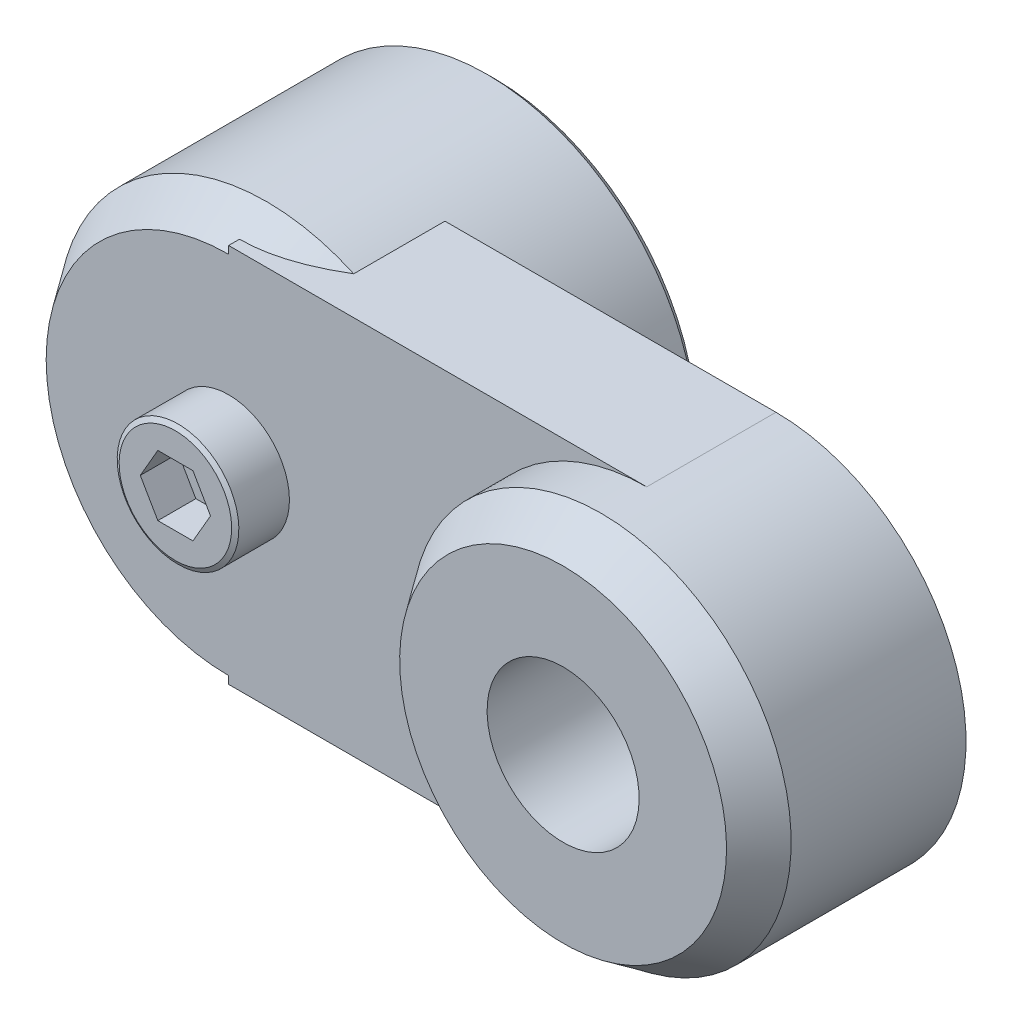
ISO-10303-21;
HEADER;
FILE_DESCRIPTION(('STEP AP214'),'2;1');
FILE_NAME('part.step','',(''),(''),'','','');
FILE_SCHEMA(('AUTOMOTIVE_DESIGN { 1 0 10303 214 1 1 1 1 }'));
ENDSEC;
DATA;
#1=APPLICATION_CONTEXT('core data for automotive mechanical design processes');
#2=APPLICATION_PROTOCOL_DEFINITION('international standard','automotive_design',2000,#1);
#3=PRODUCT_CONTEXT('',#1,'mechanical');
#4=PRODUCT('Part','Part','',(#3));
#5=PRODUCT_RELATED_PRODUCT_CATEGORY('part','',(#4));
#6=PRODUCT_DEFINITION_FORMATION('','',#4);
#7=PRODUCT_DEFINITION_CONTEXT('part definition',#1,'design');
#8=PRODUCT_DEFINITION('design','',#6,#7);
#9=PRODUCT_DEFINITION_SHAPE('','',#8);
#10=(LENGTH_UNIT() NAMED_UNIT(*) SI_UNIT(.MILLI.,.METRE.));
#11=(NAMED_UNIT(*) PLANE_ANGLE_UNIT() SI_UNIT($,.RADIAN.));
#12=(NAMED_UNIT(*) SI_UNIT($,.STERADIAN.) SOLID_ANGLE_UNIT());
#13=UNCERTAINTY_MEASURE_WITH_UNIT(LENGTH_MEASURE(1.E-05),#10,'distance_accuracy_value','');
#14=(GEOMETRIC_REPRESENTATION_CONTEXT(3) GLOBAL_UNCERTAINTY_ASSIGNED_CONTEXT((#13)) GLOBAL_UNIT_ASSIGNED_CONTEXT((#10,
#11,#12)) REPRESENTATION_CONTEXT('',''));
#15=CARTESIAN_POINT('',(0.,0.,0.));
#16=DIRECTION('',(0.,0.,1.));
#17=DIRECTION('',(1.,0.,0.));
#18=AXIS2_PLACEMENT_3D('',#15,#16,#17);
#19=CARTESIAN_POINT('',(0.,0.,35.));
#20=DIRECTION('',(0.,0.,1.));
#21=DIRECTION('',(0.,1.,0.));
#22=AXIS2_PLACEMENT_3D('',#19,#20,#21);
#23=PLANE('',#22);
#24=DIRECTION('',(-1.,0.,0.));
#25=VECTOR('',#24,1.);
#26=CARTESIAN_POINT('',(225.,-25.,35.));
#27=LINE('',#26,#25);
#28=CARTESIAN_POINT('',(55.,-25.,35.));
#29=VERTEX_POINT('',#28);
#30=CARTESIAN_POINT('',(0.,-25.,35.));
#31=VERTEX_POINT('',#30);
#32=EDGE_CURVE('E193',#29,#31,#27,.T.);
#33=ORIENTED_EDGE('',*,*,#32,.F.);
#34=CARTESIAN_POINT('',(55.,0.,35.));
#35=DIRECTION('',(0.,0.,1.));
#36=DIRECTION('',(0.,1.,0.));
#37=AXIS2_PLACEMENT_3D('',#34,#35,#36);
#38=CIRCLE('',#37,25.);
#39=CARTESIAN_POINT('',(55.,25.,35.));
#40=VERTEX_POINT('',#39);
#41=EDGE_CURVE('E173',#40,#29,#38,.T.);
#42=ORIENTED_EDGE('',*,*,#41,.F.);
#43=DIRECTION('',(-1.,0.,0.));
#44=VECTOR('',#43,1.);
#45=CARTESIAN_POINT('',(225.,25.,35.));
#46=LINE('',#45,#44);
#47=CARTESIAN_POINT('',(0.,25.,35.));
#48=VERTEX_POINT('',#47);
#49=EDGE_CURVE('E195',#40,#48,#46,.T.);
#50=ORIENTED_EDGE('',*,*,#49,.T.);
#51=DIRECTION('',(0.,1.,0.));
#52=VECTOR('',#51,1.);
#53=CARTESIAN_POINT('',(0.,-25.,35.));
#54=LINE('',#53,#52);
#55=CARTESIAN_POINT('',(0.,23.9989623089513,35.));
#56=VERTEX_POINT('',#55);
#57=EDGE_CURVE('E185',#56,#48,#54,.T.);
#58=ORIENTED_EDGE('',*,*,#57,.F.);
#59=CARTESIAN_POINT('',(0.,0.,35.));
#60=DIRECTION('',(0.,0.,1.));
#61=DIRECTION('',(0.,1.,0.));
#62=AXIS2_PLACEMENT_3D('',#59,#60,#61);
#63=CIRCLE('',#62,23.9989623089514);
#64=CARTESIAN_POINT('',(0.,-23.9989623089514,35.));
#65=VERTEX_POINT('',#64);
#66=EDGE_CURVE('E204',#56,#65,#63,.T.);
#67=ORIENTED_EDGE('',*,*,#66,.T.);
#68=EDGE_CURVE('E186',#31,#65,#54,.T.);
#69=ORIENTED_EDGE('',*,*,#68,.F.);
#70=EDGE_LOOP('',(#33,#42,#50,#58,#67,#69));
#71=FACE_BOUND('',#70,.T.);
#72=CARTESIAN_POINT('',(0.,0.,35.));
#73=DIRECTION('',(0.,0.,1.));
#74=DIRECTION('',(0.,1.,0.));
#75=AXIS2_PLACEMENT_3D('',#72,#73,#74);
#76=CIRCLE('',#75,8.);
#77=CARTESIAN_POINT('',(0.,8.,35.));
#78=VERTEX_POINT('',#77);
#79=EDGE_CURVE('E164',#78,#78,#76,.T.);
#80=ORIENTED_EDGE('',*,*,#79,.F.);
#81=EDGE_LOOP('',(#80));
#82=FACE_BOUND('',#81,.T.);
#83=ADVANCED_FACE('F14',(#71,#82),#23,.T.);
#84=CARTESIAN_POINT('',(225.,-25.,18.));
#85=DIRECTION('',(0.,0.,1.));
#86=DIRECTION('',(0.,1.,0.));
#87=AXIS2_PLACEMENT_3D('',#84,#85,#86);
#88=PLANE('',#87);
#89=CARTESIAN_POINT('',(55.,0.,18.));
#90=DIRECTION('',(0.,0.,1.));
#91=DIRECTION('',(0.,1.,0.));
#92=AXIS2_PLACEMENT_3D('',#89,#90,#91);
#93=CIRCLE('',#92,10.);
#94=CARTESIAN_POINT('',(55.,10.,18.));
#95=VERTEX_POINT('',#94);
#96=EDGE_CURVE('E170',#95,#95,#93,.T.);
#97=ORIENTED_EDGE('',*,*,#96,.T.);
#98=EDGE_LOOP('',(#97));
#99=FACE_BOUND('',#98,.T.);
#100=CARTESIAN_POINT('',(55.,0.,18.));
#101=DIRECTION('',(0.,0.,1.));
#102=DIRECTION('',(0.,1.,0.));
#103=AXIS2_PLACEMENT_3D('',#100,#101,#102);
#104=CIRCLE('',#103,25.);
#105=CARTESIAN_POINT('',(55.,-25.,18.));
#106=VERTEX_POINT('',#105);
#107=CARTESIAN_POINT('',(55.,25.,18.));
#108=VERTEX_POINT('',#107);
#109=EDGE_CURVE('E180',#106,#108,#104,.T.);
#110=ORIENTED_EDGE('',*,*,#109,.F.);
#111=DIRECTION('',(-1.,0.,0.));
#112=VECTOR('',#111,1.);
#113=CARTESIAN_POINT('',(225.,-25.,18.));
#114=LINE('',#113,#112);
#115=CARTESIAN_POINT('',(11.4564392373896,-25.,18.));
#116=VERTEX_POINT('',#115);
#117=EDGE_CURVE('E191',#106,#116,#114,.T.);
#118=ORIENTED_EDGE('',*,*,#117,.T.);
#119=CARTESIAN_POINT('',(0.,0.,18.));
#120=DIRECTION('',(0.,0.,1.));
#121=DIRECTION('',(0.,1.,0.));
#122=AXIS2_PLACEMENT_3D('',#119,#120,#121);
#123=CIRCLE('',#122,27.5);
#124=CARTESIAN_POINT('',(11.4564392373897,25.,18.));
#125=VERTEX_POINT('',#124);
#126=EDGE_CURVE('E242',#116,#125,#123,.T.);
#127=ORIENTED_EDGE('',*,*,#126,.T.);
#128=DIRECTION('',(-1.,0.,0.));
#129=VECTOR('',#128,1.);
#130=CARTESIAN_POINT('',(225.,25.,18.));
#131=LINE('',#130,#129);
#132=EDGE_CURVE('E197',#108,#125,#131,.T.);
#133=ORIENTED_EDGE('',*,*,#132,.F.);
#134=EDGE_LOOP('',(#110,#118,#127,#133));
#135=FACE_BOUND('',#134,.T.);
#136=ADVANCED_FACE('F249',(#99,#135),#88,.F.);
#137=CARTESIAN_POINT('',(225.,25.,18.));
#138=DIRECTION('',(0.,-1.,0.));
#139=DIRECTION('',(0.,0.,1.));
#140=AXIS2_PLACEMENT_3D('',#137,#138,#139);
#141=PLANE('',#140);
#142=DIRECTION('',(0.,0.,1.));
#143=VECTOR('',#142,1.);
#144=CARTESIAN_POINT('',(55.,25.,-190.));
#145=LINE('',#144,#143);
#146=EDGE_CURVE('E177',#108,#40,#145,.T.);
#147=ORIENTED_EDGE('',*,*,#146,.F.);
#148=ORIENTED_EDGE('',*,*,#132,.T.);
#149=DIRECTION('',(0.,0.,-1.));
#150=VECTOR('',#149,1.);
#151=CARTESIAN_POINT('',(11.4564392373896,25.,35.));
#152=LINE('',#151,#150);
#153=CARTESIAN_POINT('',(11.4564392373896,25.,30.));
#154=VERTEX_POINT('',#153);
#155=EDGE_CURVE('E202',#125,#154,#152,.F.);
#156=ORIENTED_EDGE('',*,*,#155,.T.);
#157=CARTESIAN_POINT('',(23.5156337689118,25.,20.2574791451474));
#158=CARTESIAN_POINT('',(23.2610089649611,25.,20.5066251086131));
#159=CARTESIAN_POINT('',(23.0053157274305,25.,20.7546780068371));
#160=CARTESIAN_POINT('',(22.4916376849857,25.,21.2484095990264));
#161=CARTESIAN_POINT('',(22.2336528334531,25.,21.494088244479));
#162=CARTESIAN_POINT('',(21.4559147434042,25.,22.22738778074));
#163=CARTESIAN_POINT('',(20.9325052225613,25.,22.7111474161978));
#164=CARTESIAN_POINT('',(19.8703592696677,25.,23.6702717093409));
#165=CARTESIAN_POINT('',(19.3315334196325,25.,24.1455375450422));
#166=CARTESIAN_POINT('',(18.2410725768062,25.,25.0810986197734));
#167=CARTESIAN_POINT('',(17.6894385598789,25.,25.5413949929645));
#168=CARTESIAN_POINT('',(16.536069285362,25.,26.4724714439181));
#169=CARTESIAN_POINT('',(15.9333741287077,25.,26.9420679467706));
#170=CARTESIAN_POINT('',(14.7087965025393,25.,27.855905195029));
#171=CARTESIAN_POINT('',(14.0869108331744,25.,28.3001416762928));
#172=CARTESIAN_POINT('',(12.8233471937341,25.,29.1553203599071));
#173=CARTESIAN_POINT('',(12.1817372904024,25.,29.5663624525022));
#174=CARTESIAN_POINT('',(10.8745497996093,25.,30.3480942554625));
#175=CARTESIAN_POINT('',(10.2089835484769,25.,30.7188027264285));
#176=CARTESIAN_POINT('',(8.87691400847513,25.,31.3964503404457));
#177=CARTESIAN_POINT('',(8.21136361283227,25.,31.7052465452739));
#178=CARTESIAN_POINT('',(6.85530500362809,25.,32.2639642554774));
#179=CARTESIAN_POINT('',(6.16479209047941,25.,32.5138746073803));
#180=CARTESIAN_POINT('',(5.12030630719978,25.,32.8323618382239));
#181=CARTESIAN_POINT('',(4.77458189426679,25.,32.9283607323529));
#182=CARTESIAN_POINT('',(4.07850406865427,25.,33.101676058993));
#183=CARTESIAN_POINT('',(3.72815154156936,25.,33.178996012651));
#184=CARTESIAN_POINT('',(3.02379681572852,25.,33.3136098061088));
#185=CARTESIAN_POINT('',(2.66979659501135,25.,33.3709139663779));
#186=CARTESIAN_POINT('',(1.95902577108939,25.,33.464483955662));
#187=CARTESIAN_POINT('',(1.60225535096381,25.,33.5007511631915));
#188=CARTESIAN_POINT('',(0.940908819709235,25.,33.5477212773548));
#189=CARTESIAN_POINT('',(0.636544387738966,25.,33.5614464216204));
#190=CARTESIAN_POINT('',(0.0274690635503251,25.,33.5729969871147));
#191=CARTESIAN_POINT('',(-0.277241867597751,25.,33.5708203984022));
#192=CARTESIAN_POINT('',(-0.886299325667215,25.,33.5505875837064));
#193=CARTESIAN_POINT('',(-1.19064556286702,25.,33.5325226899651));
#194=CARTESIAN_POINT('',(-1.7979599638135,25.,33.480772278));
#195=CARTESIAN_POINT('',(-2.10092830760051,25.,33.4470888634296));
#196=CARTESIAN_POINT('',(-2.71519481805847,25.,33.3631579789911));
#197=CARTESIAN_POINT('',(-3.02642028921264,25.,33.3123797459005));
#198=CARTESIAN_POINT('',(-3.64596973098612,25.,33.1953433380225));
#199=CARTESIAN_POINT('',(-3.95429339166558,25.,33.1290835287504));
#200=CARTESIAN_POINT('',(-4.56711836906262,25.,32.9820375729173));
#201=CARTESIAN_POINT('',(-4.87162314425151,25.,32.9012657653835));
#202=CARTESIAN_POINT('',(-5.47661118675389,25.,32.7261638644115));
#203=CARTESIAN_POINT('',(-5.77709569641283,25.,32.6318380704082));
#204=CARTESIAN_POINT('',(-6.07541297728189,25.,32.5312150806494));
#205=B_SPLINE_CURVE_WITH_KNOTS('',3,(#157,#158,#159,#160,#161,#162,#163,#164,#165,#166,#167,
#168,#169,#170,#171,#172,#173,#174,#175,#176,#177,#178,#179,#180,#181,#182,#183,#184,#185,#186,
#187,#188,#189,#190,#191,#192,#193,#194,#195,#196,#197,#198,#199,#200,#201,#202,#203,#204),
.UNSPECIFIED.,.F.,.F.,(4,2,2,2,2,2,2,2,2,2,2,2,2,2,2,2,2,2,2,2,2,2,2,4),(0.,1.06871624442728,
2.13745427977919,4.27546508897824,6.43067282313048,8.58571688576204,10.8773030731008,
13.1692734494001,15.4540676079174,17.7377944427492,19.9367026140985,22.1360269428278,
23.2120150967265,24.2878002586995,25.3630299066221,26.4381890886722,27.3518103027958,
28.2655469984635,29.1797824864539,30.0938948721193,31.0395053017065,31.9852156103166,
32.9299965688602,33.8744784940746),.UNSPECIFIED.);
#206=CARTESIAN_POINT('',(0.,25.,33.5703700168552));
#207=VERTEX_POINT('',#206);
#208=EDGE_CURVE('E213',#207,#154,#205,.F.);
#209=ORIENTED_EDGE('',*,*,#208,.F.);
#210=DIRECTION('',(0.,0.,1.));
#211=VECTOR('',#210,1.);
#212=CARTESIAN_POINT('',(0.,25.,18.));
#213=LINE('',#212,#211);
#214=EDGE_CURVE('E182',#207,#48,#213,.T.);
#215=ORIENTED_EDGE('',*,*,#214,.T.);
#216=ORIENTED_EDGE('',*,*,#49,.F.);
#217=EDGE_LOOP('',(#147,#148,#156,#209,#215,#216));
#218=FACE_BOUND('',#217,.T.);
#219=ADVANCED_FACE('F224',(#218),#141,.F.);
#220=CARTESIAN_POINT('',(225.,-25.,18.));
#221=DIRECTION('',(0.,-1.,0.));
#222=DIRECTION('',(0.,0.,1.));
#223=AXIS2_PLACEMENT_3D('',#220,#221,#222);
#224=PLANE('',#223);
#225=ORIENTED_EDGE('',*,*,#117,.F.);
#226=DIRECTION('',(0.,0.,1.));
#227=VECTOR('',#226,1.);
#228=CARTESIAN_POINT('',(55.,-25.,-190.));
#229=LINE('',#228,#227);
#230=EDGE_CURVE('E37',#106,#29,#229,.T.);
#231=ORIENTED_EDGE('',*,*,#230,.T.);
#232=ORIENTED_EDGE('',*,*,#32,.T.);
#233=DIRECTION('',(0.,0.,1.));
#234=VECTOR('',#233,1.);
#235=CARTESIAN_POINT('',(0.,-25.,18.));
#236=LINE('',#235,#234);
#237=CARTESIAN_POINT('',(0.,-25.,33.5703700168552));
#238=VERTEX_POINT('',#237);
#239=EDGE_CURVE('E188',#238,#31,#236,.T.);
#240=ORIENTED_EDGE('',*,*,#239,.F.);
#241=CARTESIAN_POINT('',(23.5156337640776,-25.,20.2574791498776));
#242=CARTESIAN_POINT('',(23.261008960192,-25.,20.5066251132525));
#243=CARTESIAN_POINT('',(23.0053157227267,-25.,20.7546780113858));
#244=CARTESIAN_POINT('',(22.4916376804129,-25.,21.2484096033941));
#245=CARTESIAN_POINT('',(22.2336528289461,-25.,21.4940882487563));
#246=CARTESIAN_POINT('',(21.4559147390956,-25.,22.2273877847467));
#247=CARTESIAN_POINT('',(20.9325052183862,-25.,22.7111474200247));
#248=CARTESIAN_POINT('',(19.8703592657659,-25.,23.6702717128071));
#249=CARTESIAN_POINT('',(19.3315334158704,-25.,24.1455375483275));
#250=CARTESIAN_POINT('',(18.2410725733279,-25.,25.0810986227));
#251=CARTESIAN_POINT('',(17.6894385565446,-25.,25.5413949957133));
#252=CARTESIAN_POINT('',(16.5360692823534,-25.,26.4724714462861));
#253=CARTESIAN_POINT('',(15.9333741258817,-25.,26.9420679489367));
#254=CARTESIAN_POINT('',(14.7087965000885,-25.,27.8559051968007));
#255=CARTESIAN_POINT('',(14.086910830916,-25.,28.3001416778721));
#256=CARTESIAN_POINT('',(12.8233471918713,-25.,29.1553203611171));
#257=CARTESIAN_POINT('',(12.1817372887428,-25.,29.5663624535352));
#258=CARTESIAN_POINT('',(10.8745497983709,-25.,30.3480942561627));
#259=CARTESIAN_POINT('',(10.2089835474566,-25.,30.7188027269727));
#260=CARTESIAN_POINT('',(8.8769140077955,-25.,31.3964503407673));
#261=CARTESIAN_POINT('',(8.21136361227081,-25.,31.7052465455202));
#262=CARTESIAN_POINT('',(6.85530500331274,-25.,32.2639642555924));
#263=CARTESIAN_POINT('',(6.16479209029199,-25.,32.5138746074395));
#264=CARTESIAN_POINT('',(5.12030630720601,-25.,32.832361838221));
#265=CARTESIAN_POINT('',(4.77458189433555,-25.,32.9283607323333));
#266=CARTESIAN_POINT('',(4.07850406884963,-25.,33.1016760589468));
#267=CARTESIAN_POINT('',(3.72815154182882,-25.,33.1789960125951));
#268=CARTESIAN_POINT('',(3.02379681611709,-25.,33.3136098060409));
#269=CARTESIAN_POINT('',(2.66979659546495,-25.,33.3709139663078));
#270=CARTESIAN_POINT('',(1.95902577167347,-25.,33.4644839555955));
#271=CARTESIAN_POINT('',(1.60225535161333,-25.,33.5007511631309));
#272=CARTESIAN_POINT('',(0.940908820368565,-25.,33.5477212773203));
#273=CARTESIAN_POINT('',(0.636544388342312,-25.,33.5614464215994));
#274=CARTESIAN_POINT('',(0.0274690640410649,-25.,33.5729969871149));
#275=CARTESIAN_POINT('',(-0.277241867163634,-25.,33.5708203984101));
#276=CARTESIAN_POINT('',(-0.886299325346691,-25.,33.5505875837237));
#277=CARTESIAN_POINT('',(-1.19064556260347,-25.,33.532522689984));
#278=CARTESIAN_POINT('',(-1.79795996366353,-25.,33.4807722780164));
#279=CARTESIAN_POINT('',(-2.10092830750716,-25.,33.4470888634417));
#280=CARTESIAN_POINT('',(-2.71519481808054,-25.,33.3631579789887));
#281=CARTESIAN_POINT('',(-3.02642028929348,-25.,33.3123797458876));
#282=CARTESIAN_POINT('',(-3.6459697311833,-25.,33.1953433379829));
#283=CARTESIAN_POINT('',(-3.95429339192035,-25.,33.1290835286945));
#284=CARTESIAN_POINT('',(-4.56711836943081,-25.,32.9820375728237));
#285=CARTESIAN_POINT('',(-4.87162314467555,-25.,32.9012657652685));
#286=CARTESIAN_POINT('',(-5.47661118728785,-25.,32.7261638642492));
#287=CARTESIAN_POINT('',(-5.77709569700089,-25.,32.63183807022));
#288=CARTESIAN_POINT('',(-6.07541297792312,-25.,32.5312150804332));
#289=B_SPLINE_CURVE_WITH_KNOTS('',3,(#241,#242,#243,#244,#245,#246,#247,#248,#249,#250,#251,
#252,#253,#254,#255,#256,#257,#258,#259,#260,#261,#262,#263,#264,#265,#266,#267,#268,#269,#270,
#271,#272,#273,#274,#275,#276,#277,#278,#279,#280,#281,#282,#283,#284,#285,#286,#287,#288),
.UNSPECIFIED.,.F.,.F.,(4,2,2,2,2,2,2,2,2,2,2,2,2,2,2,2,2,2,2,2,2,2,2,4),(0.,1.06871624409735,
2.13745427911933,4.27546508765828,6.43067282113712,8.58571688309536,10.8773030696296,
13.1692734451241,15.4540676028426,17.7377944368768,19.9367026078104,22.1360269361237,
23.2120150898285,24.2878002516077,25.3630298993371,26.438189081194,27.351810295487,
28.2655469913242,29.1797824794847,30.09389486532,31.0395052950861,31.9852156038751,
32.9299965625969,33.8744784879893),.UNSPECIFIED.);
#290=CARTESIAN_POINT('',(11.4564392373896,-25.,30.));
#291=VERTEX_POINT('',#290);
#292=EDGE_CURVE('E236',#238,#291,#289,.F.);
#293=ORIENTED_EDGE('',*,*,#292,.T.);
#294=DIRECTION('',(0.,0.,-1.));
#295=VECTOR('',#294,1.);
#296=CARTESIAN_POINT('',(11.4564392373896,-25.,35.));
#297=LINE('',#296,#295);
#298=EDGE_CURVE('E199',#116,#291,#297,.F.);
#299=ORIENTED_EDGE('',*,*,#298,.F.);
#300=EDGE_LOOP('',(#225,#231,#232,#240,#293,#299));
#301=FACE_BOUND('',#300,.T.);
#302=ADVANCED_FACE('F244',(#301),#224,.T.);
#303=CARTESIAN_POINT('',(0.,0.,35.));
#304=DIRECTION('',(0.,0.,-1.));
#305=DIRECTION('',(0.,-1.,0.));
#306=AXIS2_PLACEMENT_3D('',#303,#304,#305);
#307=CYLINDRICAL_SURFACE('',#306,27.5);
#308=CARTESIAN_POINT('',(0.,0.,1.00000000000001));
#309=DIRECTION('',(0.,0.,1.));
#310=DIRECTION('',(0.,1.,0.));
#311=AXIS2_PLACEMENT_3D('',#308,#309,#310);
#312=CIRCLE('',#311,27.5);
#313=CARTESIAN_POINT('',(0.,27.5,1.00000000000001));
#314=VERTEX_POINT('',#313);
#315=EDGE_CURVE('E330',#314,#314,#312,.T.);
#316=ORIENTED_EDGE('',*,*,#315,.T.);
#317=EDGE_LOOP('',(#316));
#318=FACE_BOUND('',#317,.T.);
#319=ORIENTED_EDGE('',*,*,#155,.F.);
#320=ORIENTED_EDGE('',*,*,#126,.F.);
#321=ORIENTED_EDGE('',*,*,#298,.T.);
#322=CARTESIAN_POINT('',(0.,0.,30.));
#323=DIRECTION('',(0.,0.,1.));
#324=DIRECTION('',(0.,1.,0.));
#325=AXIS2_PLACEMENT_3D('',#322,#323,#324);
#326=CIRCLE('',#325,27.5);
#327=EDGE_CURVE('E207',#291,#154,#326,.F.);
#328=ORIENTED_EDGE('',*,*,#327,.T.);
#329=EDGE_LOOP('',(#319,#320,#321,#328));
#330=FACE_BOUND('',#329,.T.);
#331=ADVANCED_FACE('F248',(#318,#330),#307,.T.);
#332=CARTESIAN_POINT('',(0.,0.,0.));
#333=DIRECTION('',(0.,0.,1.));
#334=DIRECTION('',(0.,1.,0.));
#335=AXIS2_PLACEMENT_3D('',#332,#333,#334);
#336=PLANE('',#335);
#337=CARTESIAN_POINT('',(0.,0.,0.));
#338=DIRECTION('',(0.,0.,1.));
#339=DIRECTION('',(0.,1.,0.));
#340=AXIS2_PLACEMENT_3D('',#337,#338,#339);
#341=CIRCLE('',#340,26.5);
#342=CARTESIAN_POINT('',(0.,26.5,0.));
#343=VERTEX_POINT('',#342);
#344=EDGE_CURVE('E505',#343,#343,#341,.F.);
#345=ORIENTED_EDGE('',*,*,#344,.T.);
#346=EDGE_LOOP('',(#345));
#347=FACE_BOUND('',#346,.T.);
#348=ADVANCED_FACE('F232',(#347),#336,.F.);
#349=CARTESIAN_POINT('',(0.,0.,35.));
#350=DIRECTION('',(0.,0.,-1.));
#351=DIRECTION('',(0.,-1.,0.));
#352=AXIS2_PLACEMENT_3D('',#349,#350,#351);
#353=CONICAL_SURFACE('',#352,23.9989623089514,0.610865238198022);
#354=ORIENTED_EDGE('',*,*,#292,.F.);
#355=DIRECTION('',(0.,-0.573576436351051,-0.819152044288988));
#356=VECTOR('',#355,1.);
#357=CARTESIAN_POINT('',(0.,0.,69.2740701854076));
#358=LINE('',#357,#356);
#359=EDGE_CURVE('E222',#238,#65,#358,.F.);
#360=ORIENTED_EDGE('',*,*,#359,.T.);
#361=ORIENTED_EDGE('',*,*,#66,.F.);
#362=DIRECTION('',(0.,-0.573576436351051,0.819152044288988));
#363=VECTOR('',#362,1.);
#364=CARTESIAN_POINT('',(0.,0.,69.2740701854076));
#365=LINE('',#364,#363);
#366=EDGE_CURVE('E210',#56,#207,#365,.F.);
#367=ORIENTED_EDGE('',*,*,#366,.T.);
#368=ORIENTED_EDGE('',*,*,#208,.T.);
#369=ORIENTED_EDGE('',*,*,#327,.F.);
#370=EDGE_LOOP('',(#354,#360,#361,#367,#368,#369));
#371=FACE_BOUND('',#370,.T.);
#372=ADVANCED_FACE('F227',(#371),#353,.T.);
#373=CARTESIAN_POINT('',(0.,25.,18.));
#374=DIRECTION('',(1.,0.,0.));
#375=DIRECTION('',(0.,0.,-1.));
#376=AXIS2_PLACEMENT_3D('',#373,#374,#375);
#377=PLANE('',#376);
#378=ORIENTED_EDGE('',*,*,#359,.F.);
#379=ORIENTED_EDGE('',*,*,#239,.T.);
#380=ORIENTED_EDGE('',*,*,#68,.T.);
#381=EDGE_LOOP('',(#378,#379,#380));
#382=FACE_BOUND('',#381,.T.);
#383=ADVANCED_FACE('F231',(#382),#377,.F.);
#384=ORIENTED_EDGE('',*,*,#366,.F.);
#385=ORIENTED_EDGE('',*,*,#57,.T.);
#386=ORIENTED_EDGE('',*,*,#214,.F.);
#387=EDGE_LOOP('',(#384,#385,#386));
#388=FACE_BOUND('',#387,.T.);
#389=ADVANCED_FACE('F253',(#388),#377,.F.);
#390=CARTESIAN_POINT('',(55.,0.,-190.));
#391=DIRECTION('',(0.,0.,1.));
#392=DIRECTION('',(0.,1.,0.));
#393=AXIS2_PLACEMENT_3D('',#390,#391,#392);
#394=CYLINDRICAL_SURFACE('',#393,25.);
#395=CARTESIAN_POINT('',(55.,0.,41.));
#396=DIRECTION('',(0.,0.,1.));
#397=DIRECTION('',(0.,1.,0.));
#398=AXIS2_PLACEMENT_3D('',#395,#396,#397);
#399=CIRCLE('',#398,25.);
#400=CARTESIAN_POINT('',(55.,25.,41.));
#401=VERTEX_POINT('',#400);
#402=EDGE_CURVE('E498',#401,#401,#399,.F.);
#403=ORIENTED_EDGE('',*,*,#402,.T.);
#404=EDGE_LOOP('',(#403));
#405=FACE_BOUND('',#404,.T.);
#406=ORIENTED_EDGE('',*,*,#109,.T.);
#407=ORIENTED_EDGE('',*,*,#146,.T.);
#408=ORIENTED_EDGE('',*,*,#41,.T.);
#409=ORIENTED_EDGE('',*,*,#230,.F.);
#410=EDGE_LOOP('',(#406,#407,#408,#409));
#411=FACE_BOUND('',#410,.T.);
#412=ADVANCED_FACE('F256',(#405,#411),#394,.T.);
#413=CARTESIAN_POINT('',(55.,0.,46.));
#414=DIRECTION('',(0.,0.,1.));
#415=DIRECTION('',(0.,1.,0.));
#416=AXIS2_PLACEMENT_3D('',#413,#414,#415);
#417=PLANE('',#416);
#418=CARTESIAN_POINT('',(55.,0.,46.));
#419=DIRECTION('',(0.,0.,1.));
#420=DIRECTION('',(0.,1.,0.));
#421=AXIS2_PLACEMENT_3D('',#418,#419,#420);
#422=CIRCLE('',#421,10.);
#423=CARTESIAN_POINT('',(55.,10.,46.));
#424=VERTEX_POINT('',#423);
#425=EDGE_CURVE('E167',#424,#424,#422,.T.);
#426=ORIENTED_EDGE('',*,*,#425,.F.);
#427=EDGE_LOOP('',(#426));
#428=FACE_BOUND('',#427,.T.);
#429=CARTESIAN_POINT('',(55.,0.,46.));
#430=DIRECTION('',(0.,0.,1.));
#431=DIRECTION('',(0.,1.,0.));
#432=AXIS2_PLACEMENT_3D('',#429,#430,#431);
#433=CIRCLE('',#432,21.4989623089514);
#434=CARTESIAN_POINT('',(55.,21.4989623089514,46.));
#435=VERTEX_POINT('',#434);
#436=EDGE_CURVE('E496',#435,#435,#433,.T.);
#437=ORIENTED_EDGE('',*,*,#436,.T.);
#438=EDGE_LOOP('',(#437));
#439=FACE_BOUND('',#438,.T.);
#440=ADVANCED_FACE('F260',(#428,#439),#417,.T.);
#441=CARTESIAN_POINT('',(55.,0.,46.));
#442=DIRECTION('',(0.,0.,-1.));
#443=DIRECTION('',(0.,-1.,0.));
#444=AXIS2_PLACEMENT_3D('',#441,#442,#443);
#445=CONICAL_SURFACE('',#444,21.4989623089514,0.610865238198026);
#446=ORIENTED_EDGE('',*,*,#402,.F.);
#447=EDGE_LOOP('',(#446));
#448=FACE_BOUND('',#447,.T.);
#449=ORIENTED_EDGE('',*,*,#436,.F.);
#450=EDGE_LOOP('',(#449));
#451=FACE_BOUND('',#450,.T.);
#452=ADVANCED_FACE('F264',(#448,#451),#445,.T.);
#453=CARTESIAN_POINT('',(55.,0.,0.));
#454=DIRECTION('',(0.,0.,1.));
#455=DIRECTION('',(0.,1.,0.));
#456=AXIS2_PLACEMENT_3D('',#453,#454,#455);
#457=CYLINDRICAL_SURFACE('',#456,10.);
#458=ORIENTED_EDGE('',*,*,#425,.T.);
#459=EDGE_LOOP('',(#458));
#460=FACE_BOUND('',#459,.T.);
#461=ORIENTED_EDGE('',*,*,#96,.F.);
#462=EDGE_LOOP('',(#461));
#463=FACE_BOUND('',#462,.T.);
#464=ADVANCED_FACE('F268',(#460,#463),#457,.F.);
#465=CARTESIAN_POINT('',(0.,0.,42.));
#466=DIRECTION('',(0.,0.,-1.));
#467=DIRECTION('',(0.,-1.,0.));
#468=AXIS2_PLACEMENT_3D('',#465,#466,#467);
#469=CYLINDRICAL_SURFACE('',#468,8.);
#470=CARTESIAN_POINT('',(0.,0.,41.6535898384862));
#471=DIRECTION('',(0.,0.,1.));
#472=DIRECTION('',(0.,-1.,0.));
#473=AXIS2_PLACEMENT_3D('',#470,#471,#472);
#474=CIRCLE('',#473,8.);
#475=CARTESIAN_POINT('',(0.,-8.,41.6535898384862));
#476=VERTEX_POINT('',#475);
#477=EDGE_CURVE('E9',#476,#476,#474,.F.);
#478=ORIENTED_EDGE('',*,*,#477,.T.);
#479=EDGE_LOOP('',(#478));
#480=FACE_BOUND('',#479,.T.);
#481=ORIENTED_EDGE('',*,*,#79,.T.);
#482=EDGE_LOOP('',(#481));
#483=FACE_BOUND('',#482,.T.);
#484=ADVANCED_FACE('F272',(#480,#483),#469,.T.);
#485=CARTESIAN_POINT('',(0.,0.,42.));
#486=DIRECTION('',(0.,0.,1.));
#487=DIRECTION('',(0.,1.,0.));
#488=AXIS2_PLACEMENT_3D('',#485,#486,#487);
#489=PLANE('',#488);
#490=CARTESIAN_POINT('',(0.,0.,42.));
#491=DIRECTION('',(0.,0.,1.));
#492=DIRECTION('',(0.,-1.,0.));
#493=AXIS2_PLACEMENT_3D('',#490,#491,#492);
#494=CIRCLE('',#493,7.4);
#495=CARTESIAN_POINT('',(0.,-7.4,42.));
#496=VERTEX_POINT('',#495);
#497=EDGE_CURVE('E22',#496,#496,#494,.T.);
#498=ORIENTED_EDGE('',*,*,#497,.T.);
#499=EDGE_LOOP('',(#498));
#500=FACE_BOUND('',#499,.T.);
#501=DIRECTION('',(-0.5,-0.866025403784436,0.));
#502=VECTOR('',#501,1.);
#503=CARTESIAN_POINT('',(-2.30940107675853,4.,42.));
#504=LINE('',#503,#502);
#505=CARTESIAN_POINT('',(-2.30940107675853,4.,42.));
#506=VERTEX_POINT('',#505);
#507=CARTESIAN_POINT('',(-4.61880215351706,0.,42.));
#508=VERTEX_POINT('',#507);
#509=EDGE_CURVE('E29',#506,#508,#504,.T.);
#510=ORIENTED_EDGE('',*,*,#509,.F.);
#511=DIRECTION('',(1.,0.,0.));
#512=VECTOR('',#511,1.);
#513=CARTESIAN_POINT('',(-2.30940107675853,4.,42.));
#514=LINE('',#513,#512);
#515=CARTESIAN_POINT('',(2.30940107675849,4.,42.));
#516=VERTEX_POINT('',#515);
#517=EDGE_CURVE('E138',#506,#516,#514,.T.);
#518=ORIENTED_EDGE('',*,*,#517,.T.);
#519=DIRECTION('',(0.5,-0.86602540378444,0.));
#520=VECTOR('',#519,1.);
#521=CARTESIAN_POINT('',(2.30940107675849,4.,42.));
#522=LINE('',#521,#520);
#523=CARTESIAN_POINT('',(4.61880215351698,0.,42.));
#524=VERTEX_POINT('',#523);
#525=EDGE_CURVE('E133',#516,#524,#522,.T.);
#526=ORIENTED_EDGE('',*,*,#525,.T.);
#527=DIRECTION('',(0.5,0.86602540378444,0.));
#528=VECTOR('',#527,1.);
#529=CARTESIAN_POINT('',(2.30940107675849,-4.,42.));
#530=LINE('',#529,#528);
#531=CARTESIAN_POINT('',(2.30940107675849,-4.,42.));
#532=VERTEX_POINT('',#531);
#533=EDGE_CURVE('E131',#532,#524,#530,.T.);
#534=ORIENTED_EDGE('',*,*,#533,.F.);
#535=DIRECTION('',(1.,0.,0.));
#536=VECTOR('',#535,1.);
#537=CARTESIAN_POINT('',(-2.30940107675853,-4.,42.));
#538=LINE('',#537,#536);
#539=CARTESIAN_POINT('',(-2.30940107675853,-4.,42.));
#540=VERTEX_POINT('',#539);
#541=EDGE_CURVE('E113',#540,#532,#538,.T.);
#542=ORIENTED_EDGE('',*,*,#541,.F.);
#543=DIRECTION('',(-0.5,0.866025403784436,0.));
#544=VECTOR('',#543,1.);
#545=CARTESIAN_POINT('',(-2.30940107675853,-4.,42.));
#546=LINE('',#545,#544);
#547=EDGE_CURVE('E124',#540,#508,#546,.T.);
#548=ORIENTED_EDGE('',*,*,#547,.T.);
#549=EDGE_LOOP('',(#510,#518,#526,#534,#542,#548));
#550=FACE_BOUND('',#549,.T.);
#551=ADVANCED_FACE('F128',(#500,#550),#489,.T.);
#552=CARTESIAN_POINT('',(-2.30940107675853,4.,37.));
#553=DIRECTION('',(-0.866025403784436,0.5,0.));
#554=DIRECTION('',(-0.5,-0.866025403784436,0.));
#555=AXIS2_PLACEMENT_3D('',#552,#553,#554);
#556=PLANE('',#555);
#557=DIRECTION('',(0.,0.,1.));
#558=VECTOR('',#557,1.);
#559=CARTESIAN_POINT('',(-2.30940107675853,4.,37.));
#560=LINE('',#559,#558);
#561=CARTESIAN_POINT('',(-2.30940107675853,4.,37.));
#562=VERTEX_POINT('',#561);
#563=EDGE_CURVE('E162',#562,#506,#560,.T.);
#564=ORIENTED_EDGE('',*,*,#563,.T.);
#565=ORIENTED_EDGE('',*,*,#509,.T.);
#566=DIRECTION('',(0.,0.,1.));
#567=VECTOR('',#566,1.);
#568=CARTESIAN_POINT('',(-4.61880215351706,0.,37.));
#569=LINE('',#568,#567);
#570=CARTESIAN_POINT('',(-4.61880215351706,0.,37.));
#571=VERTEX_POINT('',#570);
#572=EDGE_CURVE('E121',#571,#508,#569,.T.);
#573=ORIENTED_EDGE('',*,*,#572,.F.);
#574=DIRECTION('',(-0.5,-0.866025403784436,0.));
#575=VECTOR('',#574,1.);
#576=CARTESIAN_POINT('',(-2.30940107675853,4.,37.));
#577=LINE('',#576,#575);
#578=EDGE_CURVE('E141',#562,#571,#577,.T.);
#579=ORIENTED_EDGE('',*,*,#578,.F.);
#580=EDGE_LOOP('',(#564,#565,#573,#579));
#581=FACE_BOUND('',#580,.T.);
#582=ADVANCED_FACE('F277',(#581),#556,.F.);
#583=CARTESIAN_POINT('',(-2.30940107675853,4.,37.));
#584=DIRECTION('',(0.,-1.,0.));
#585=DIRECTION('',(1.,0.,0.));
#586=AXIS2_PLACEMENT_3D('',#583,#584,#585);
#587=PLANE('',#586);
#588=DIRECTION('',(0.,0.,1.));
#589=VECTOR('',#588,1.);
#590=CARTESIAN_POINT('',(2.30940107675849,4.,37.));
#591=LINE('',#590,#589);
#592=CARTESIAN_POINT('',(2.30940107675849,4.,37.));
#593=VERTEX_POINT('',#592);
#594=EDGE_CURVE('E160',#593,#516,#591,.T.);
#595=ORIENTED_EDGE('',*,*,#594,.T.);
#596=ORIENTED_EDGE('',*,*,#517,.F.);
#597=ORIENTED_EDGE('',*,*,#563,.F.);
#598=DIRECTION('',(1.,0.,0.));
#599=VECTOR('',#598,1.);
#600=CARTESIAN_POINT('',(-2.30940107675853,4.,37.));
#601=LINE('',#600,#599);
#602=EDGE_CURVE('E153',#562,#593,#601,.T.);
#603=ORIENTED_EDGE('',*,*,#602,.T.);
#604=EDGE_LOOP('',(#595,#596,#597,#603));
#605=FACE_BOUND('',#604,.T.);
#606=ADVANCED_FACE('F281',(#605),#587,.T.);
#607=CARTESIAN_POINT('',(2.30940107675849,4.,37.));
#608=DIRECTION('',(-0.86602540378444,-0.5,0.));
#609=DIRECTION('',(0.5,-0.86602540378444,0.));
#610=AXIS2_PLACEMENT_3D('',#607,#608,#609);
#611=PLANE('',#610);
#612=DIRECTION('',(0.,0.,1.));
#613=VECTOR('',#612,1.);
#614=CARTESIAN_POINT('',(4.61880215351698,0.,37.));
#615=LINE('',#614,#613);
#616=CARTESIAN_POINT('',(4.61880215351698,0.,37.));
#617=VERTEX_POINT('',#616);
#618=EDGE_CURVE('E158',#617,#524,#615,.T.);
#619=ORIENTED_EDGE('',*,*,#618,.T.);
#620=ORIENTED_EDGE('',*,*,#525,.F.);
#621=ORIENTED_EDGE('',*,*,#594,.F.);
#622=DIRECTION('',(0.5,-0.86602540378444,0.));
#623=VECTOR('',#622,1.);
#624=CARTESIAN_POINT('',(2.30940107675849,4.,37.));
#625=LINE('',#624,#623);
#626=EDGE_CURVE('E150',#593,#617,#625,.T.);
#627=ORIENTED_EDGE('',*,*,#626,.T.);
#628=EDGE_LOOP('',(#619,#620,#621,#627));
#629=FACE_BOUND('',#628,.T.);
#630=ADVANCED_FACE('F284',(#629),#611,.T.);
#631=CARTESIAN_POINT('',(2.30940107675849,-4.,37.));
#632=DIRECTION('',(0.86602540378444,-0.5,0.));
#633=DIRECTION('',(0.5,0.86602540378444,0.));
#634=AXIS2_PLACEMENT_3D('',#631,#632,#633);
#635=PLANE('',#634);
#636=DIRECTION('',(0.,0.,1.));
#637=VECTOR('',#636,1.);
#638=CARTESIAN_POINT('',(2.30940107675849,-4.,37.));
#639=LINE('',#638,#637);
#640=CARTESIAN_POINT('',(2.30940107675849,-4.,37.));
#641=VERTEX_POINT('',#640);
#642=EDGE_CURVE('E120',#641,#532,#639,.T.);
#643=ORIENTED_EDGE('',*,*,#642,.T.);
#644=ORIENTED_EDGE('',*,*,#533,.T.);
#645=ORIENTED_EDGE('',*,*,#618,.F.);
#646=DIRECTION('',(0.5,0.86602540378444,0.));
#647=VECTOR('',#646,1.);
#648=CARTESIAN_POINT('',(2.30940107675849,-4.,37.));
#649=LINE('',#648,#647);
#650=EDGE_CURVE('E147',#641,#617,#649,.T.);
#651=ORIENTED_EDGE('',*,*,#650,.F.);
#652=EDGE_LOOP('',(#643,#644,#645,#651));
#653=FACE_BOUND('',#652,.T.);
#654=ADVANCED_FACE('F288',(#653),#635,.F.);
#655=CARTESIAN_POINT('',(-2.30940107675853,-4.,37.));
#656=DIRECTION('',(0.,-1.,0.));
#657=DIRECTION('',(1.,0.,0.));
#658=AXIS2_PLACEMENT_3D('',#655,#656,#657);
#659=PLANE('',#658);
#660=DIRECTION('',(0.,0.,1.));
#661=VECTOR('',#660,1.);
#662=CARTESIAN_POINT('',(-2.30940107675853,-4.,37.));
#663=LINE('',#662,#661);
#664=CARTESIAN_POINT('',(-2.30940107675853,-4.,37.));
#665=VERTEX_POINT('',#664);
#666=EDGE_CURVE('E109',#665,#540,#663,.T.);
#667=ORIENTED_EDGE('',*,*,#666,.T.);
#668=ORIENTED_EDGE('',*,*,#541,.T.);
#669=ORIENTED_EDGE('',*,*,#642,.F.);
#670=DIRECTION('',(1.,0.,0.));
#671=VECTOR('',#670,1.);
#672=CARTESIAN_POINT('',(-2.30940107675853,-4.,37.));
#673=LINE('',#672,#671);
#674=EDGE_CURVE('E116',#665,#641,#673,.T.);
#675=ORIENTED_EDGE('',*,*,#674,.F.);
#676=EDGE_LOOP('',(#667,#668,#669,#675));
#677=FACE_BOUND('',#676,.T.);
#678=ADVANCED_FACE('F111',(#677),#659,.F.);
#679=CARTESIAN_POINT('',(-2.30940107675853,-4.,37.));
#680=DIRECTION('',(0.866025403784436,0.5,0.));
#681=DIRECTION('',(-0.5,0.866025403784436,0.));
#682=AXIS2_PLACEMENT_3D('',#679,#680,#681);
#683=PLANE('',#682);
#684=DIRECTION('',(-0.5,0.866025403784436,0.));
#685=VECTOR('',#684,1.);
#686=CARTESIAN_POINT('',(-2.30940107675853,-4.,37.));
#687=LINE('',#686,#685);
#688=EDGE_CURVE('E144',#665,#571,#687,.T.);
#689=ORIENTED_EDGE('',*,*,#688,.T.);
#690=ORIENTED_EDGE('',*,*,#572,.T.);
#691=ORIENTED_EDGE('',*,*,#547,.F.);
#692=ORIENTED_EDGE('',*,*,#666,.F.);
#693=EDGE_LOOP('',(#689,#690,#691,#692));
#694=FACE_BOUND('',#693,.T.);
#695=ADVANCED_FACE('F125',(#694),#683,.T.);
#696=CARTESIAN_POINT('',(-4.61880215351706,0.,37.));
#697=DIRECTION('',(0.,0.,-1.));
#698=DIRECTION('',(0.,-1.,0.));
#699=AXIS2_PLACEMENT_3D('',#696,#697,#698);
#700=PLANE('',#699);
#701=ORIENTED_EDGE('',*,*,#578,.T.);
#702=ORIENTED_EDGE('',*,*,#688,.F.);
#703=ORIENTED_EDGE('',*,*,#674,.T.);
#704=ORIENTED_EDGE('',*,*,#650,.T.);
#705=ORIENTED_EDGE('',*,*,#626,.F.);
#706=ORIENTED_EDGE('',*,*,#602,.F.);
#707=EDGE_LOOP('',(#701,#702,#703,#704,#705,#706));
#708=FACE_BOUND('',#707,.T.);
#709=ADVANCED_FACE('F295',(#708),#700,.F.);
#710=CARTESIAN_POINT('',(0.,0.,1.00000000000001));
#711=DIRECTION('',(0.,0.,1.));
#712=DIRECTION('',(0.,1.,0.));
#713=AXIS2_PLACEMENT_3D('',#710,#711,#712);
#714=CONICAL_SURFACE('',#713,27.5,0.785398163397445);
#715=ORIENTED_EDGE('',*,*,#344,.F.);
#716=EDGE_LOOP('',(#715));
#717=FACE_BOUND('',#716,.T.);
#718=ORIENTED_EDGE('',*,*,#315,.F.);
#719=EDGE_LOOP('',(#718));
#720=FACE_BOUND('',#719,.T.);
#721=ADVANCED_FACE('F298',(#717,#720),#714,.T.);
#722=CARTESIAN_POINT('',(0.,0.,42.));
#723=DIRECTION('',(0.,0.,-1.));
#724=DIRECTION('',(0.,1.,0.));
#725=AXIS2_PLACEMENT_3D('',#722,#723,#724);
#726=CONICAL_SURFACE('',#725,7.4,1.0471975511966);
#727=ORIENTED_EDGE('',*,*,#477,.F.);
#728=EDGE_LOOP('',(#727));
#729=FACE_BOUND('',#728,.T.);
#730=ORIENTED_EDGE('',*,*,#497,.F.);
#731=EDGE_LOOP('',(#730));
#732=FACE_BOUND('',#731,.T.);
#733=ADVANCED_FACE('F16',(#729,#732),#726,.T.);
#734=CLOSED_SHELL('',(#83,#136,#219,#302,#331,#348,#372,#383,#389,#412,#440,#452,#464,#484,#551,
#582,#606,#630,#654,#678,#695,#709,#721,#733));
#735=MANIFOLD_SOLID_BREP('B1',#734);
#736=ADVANCED_BREP_SHAPE_REPRESENTATION('',(#18,#735),#14);
#737=SHAPE_DEFINITION_REPRESENTATION(#9,#736);
ENDSEC;
END-ISO-10303-21;
